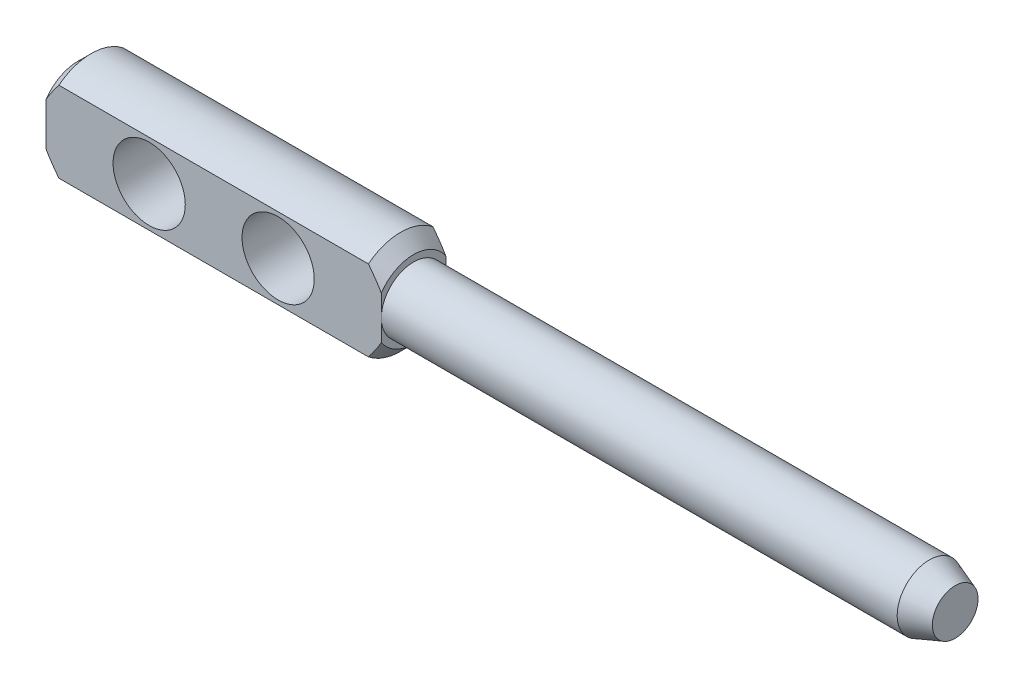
ISO-10303-21;
HEADER;
FILE_DESCRIPTION(('STEP AP214'),'2;1');
FILE_NAME('part.step','',(''),(''),'','','');
FILE_SCHEMA(('AUTOMOTIVE_DESIGN { 1 0 10303 214 1 1 1 1 }'));
ENDSEC;
DATA;
#1=APPLICATION_CONTEXT('core data for automotive mechanical design processes');
#2=APPLICATION_PROTOCOL_DEFINITION('international standard','automotive_design',2000,#1);
#3=PRODUCT_CONTEXT('',#1,'mechanical');
#4=PRODUCT('Part','Part','',(#3));
#5=PRODUCT_RELATED_PRODUCT_CATEGORY('part','',(#4));
#6=PRODUCT_DEFINITION_FORMATION('','',#4);
#7=PRODUCT_DEFINITION_CONTEXT('part definition',#1,'design');
#8=PRODUCT_DEFINITION('design','',#6,#7);
#9=PRODUCT_DEFINITION_SHAPE('','',#8);
#10=(LENGTH_UNIT() NAMED_UNIT(*) SI_UNIT(.MILLI.,.METRE.));
#11=(NAMED_UNIT(*) PLANE_ANGLE_UNIT() SI_UNIT($,.RADIAN.));
#12=(NAMED_UNIT(*) SI_UNIT($,.STERADIAN.) SOLID_ANGLE_UNIT());
#13=UNCERTAINTY_MEASURE_WITH_UNIT(LENGTH_MEASURE(1.E-05),#10,'distance_accuracy_value','');
#14=(GEOMETRIC_REPRESENTATION_CONTEXT(3) GLOBAL_UNCERTAINTY_ASSIGNED_CONTEXT((#13)) GLOBAL_UNIT_ASSIGNED_CONTEXT((#10,
#11,#12)) REPRESENTATION_CONTEXT('',''));
#15=CARTESIAN_POINT('',(0.,0.,0.));
#16=DIRECTION('',(0.,0.,1.));
#17=DIRECTION('',(1.,0.,0.));
#18=AXIS2_PLACEMENT_3D('',#15,#16,#17);
#19=CARTESIAN_POINT('',(0.,0.,0.));
#20=DIRECTION('',(1.,0.,0.));
#21=DIRECTION('',(0.,0.,-1.));
#22=AXIS2_PLACEMENT_3D('',#19,#20,#21);
#23=PLANE('',#22);
#24=DIRECTION('',(0.,1.,0.));
#25=VECTOR('',#24,1.);
#26=CARTESIAN_POINT('',(0.,-2.,1.25));
#27=LINE('',#26,#25);
#28=CARTESIAN_POINT('',(0.,-0.82915619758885,1.25));
#29=VERTEX_POINT('',#28);
#30=CARTESIAN_POINT('',(0.,0.82915619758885,1.25));
#31=VERTEX_POINT('',#30);
#32=EDGE_CURVE('E115',#29,#31,#27,.T.);
#33=ORIENTED_EDGE('',*,*,#32,.T.);
#34=CARTESIAN_POINT('',(0.,0.,0.));
#35=DIRECTION('',(-1.,0.,0.));
#36=DIRECTION('',(0.,0.,1.));
#37=AXIS2_PLACEMENT_3D('',#34,#35,#36);
#38=CIRCLE('',#37,1.5);
#39=CARTESIAN_POINT('',(0.,0.82915619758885,-1.25));
#40=VERTEX_POINT('',#39);
#41=EDGE_CURVE('E12',#31,#40,#38,.T.);
#42=ORIENTED_EDGE('',*,*,#41,.T.);
#43=DIRECTION('',(0.,-1.,0.));
#44=VECTOR('',#43,1.);
#45=CARTESIAN_POINT('',(0.,-2.,-1.25));
#46=LINE('',#45,#44);
#47=CARTESIAN_POINT('',(0.,-0.82915619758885,-1.25));
#48=VERTEX_POINT('',#47);
#49=EDGE_CURVE('E103',#40,#48,#46,.T.);
#50=ORIENTED_EDGE('',*,*,#49,.T.);
#51=EDGE_CURVE('E41',#48,#29,#38,.T.);
#52=ORIENTED_EDGE('',*,*,#51,.T.);
#53=EDGE_LOOP('',(#33,#42,#50,#52));
#54=FACE_BOUND('',#53,.T.);
#55=ADVANCED_FACE('F34',(#54),#23,.F.);
#56=CARTESIAN_POINT('',(0.5,0.,0.));
#57=DIRECTION('',(1.,0.,0.));
#58=DIRECTION('',(0.,0.,-1.));
#59=AXIS2_PLACEMENT_3D('',#56,#57,#58);
#60=CONICAL_SURFACE('',#59,2.,0.785398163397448);
#61=CARTESIAN_POINT('',(2.91887732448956,4.23839318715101,1.25));
#62=CARTESIAN_POINT('',(2.83994802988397,4.15610059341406,1.25));
#63=CARTESIAN_POINT('',(2.76111209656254,4.07371834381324,1.25));
#64=CARTESIAN_POINT('',(2.60366859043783,3.90873465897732,1.25));
#65=CARTESIAN_POINT('',(2.52506101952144,3.82613322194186,1.25));
#66=CARTESIAN_POINT('',(2.28960102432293,3.57789572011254,1.25));
#67=CARTESIAN_POINT('',(2.13315585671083,3.41187280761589,1.25));
#68=CARTESIAN_POINT('',(1.82490719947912,3.08155782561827,1.25));
#69=CARTESIAN_POINT('',(1.67307261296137,2.91729489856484,1.25));
#70=CARTESIAN_POINT('',(1.4472026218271,2.66920473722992,1.25));
#71=CARTESIAN_POINT('',(1.37223089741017,2.58623062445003,1.25));
#72=CARTESIAN_POINT('',(1.22310864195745,2.41954849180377,1.25));
#73=CARTESIAN_POINT('',(1.14895809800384,2.33584048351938,1.25));
#74=CARTESIAN_POINT('',(1.01173848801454,2.17889323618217,1.25));
#75=CARTESIAN_POINT('',(0.948531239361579,2.10577500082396,1.25));
#76=CARTESIAN_POINT('',(0.823192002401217,1.95862442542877,1.25));
#77=CARTESIAN_POINT('',(0.761059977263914,1.8845921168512,1.25));
#78=CARTESIAN_POINT('',(0.637480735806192,1.73440785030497,1.25));
#79=CARTESIAN_POINT('',(0.576051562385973,1.65824099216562,1.25));
#80=CARTESIAN_POINT('',(0.455270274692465,1.5042826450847,1.25));
#81=CARTESIAN_POINT('',(0.395917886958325,1.42649137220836,1.25));
#82=CARTESIAN_POINT('',(0.279214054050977,1.26731557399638,1.25));
#83=CARTESIAN_POINT('',(0.221915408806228,1.18589207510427,1.25));
#84=CARTESIAN_POINT('',(0.111945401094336,1.01969809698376,1.25));
#85=CARTESIAN_POINT('',(0.0592822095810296,0.934922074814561,1.25));
#86=CARTESIAN_POINT('',(-0.0135545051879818,0.805144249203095,1.25));
#87=CARTESIAN_POINT('',(-0.0366497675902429,0.761798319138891,1.25));
#88=CARTESIAN_POINT('',(-0.0804250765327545,0.67390968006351,1.25));
#89=CARTESIAN_POINT('',(-0.101104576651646,0.629366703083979,1.25));
#90=CARTESIAN_POINT('',(-0.158384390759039,0.494031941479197,1.25));
#91=CARTESIAN_POINT('',(-0.190468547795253,0.401126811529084,1.25));
#92=CARTESIAN_POINT('',(-0.223066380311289,0.264050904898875,1.25));
#93=CARTESIAN_POINT('',(-0.231202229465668,0.221669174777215,1.25));
#94=CARTESIAN_POINT('',(-0.243299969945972,0.136296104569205,1.25));
#95=CARTESIAN_POINT('',(-0.247261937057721,0.0933047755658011,1.25));
#96=CARTESIAN_POINT('',(-0.250716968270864,0.00724157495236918,1.25));
#97=CARTESIAN_POINT('',(-0.250220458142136,-0.0358298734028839,1.25));
#98=CARTESIAN_POINT('',(-0.244821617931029,-0.121695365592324,1.25));
#99=CARTESIAN_POINT('',(-0.239918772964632,-0.164489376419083,1.25));
#100=CARTESIAN_POINT('',(-0.226127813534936,-0.248935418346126,1.25));
#101=CARTESIAN_POINT('',(-0.217283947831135,-0.290594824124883,1.25));
#102=CARTESIAN_POINT('',(-0.196139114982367,-0.373016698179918,1.25));
#103=CARTESIAN_POINT('',(-0.183837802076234,-0.413779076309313,1.25));
#104=CARTESIAN_POINT('',(-0.156270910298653,-0.494527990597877,1.25));
#105=CARTESIAN_POINT('',(-0.140989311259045,-0.534508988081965,1.25));
#106=CARTESIAN_POINT('',(-0.108043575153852,-0.613454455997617,1.25));
#107=CARTESIAN_POINT('',(-0.0903799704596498,-0.652419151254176,1.25));
#108=CARTESIAN_POINT('',(-0.0306964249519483,-0.77582569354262,1.25));
#109=CARTESIAN_POINT('',(0.0150191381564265,-0.858474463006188,1.25));
#110=CARTESIAN_POINT('',(0.112257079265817,-1.02031677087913,1.25));
#111=CARTESIAN_POINT('',(0.163787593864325,-1.09950524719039,1.25));
#112=CARTESIAN_POINT('',(0.270827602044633,-1.25561290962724,1.25));
#113=CARTESIAN_POINT('',(0.3263528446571,-1.33252121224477,1.25));
#114=CARTESIAN_POINT('',(0.439924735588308,-1.48436480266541,1.25));
#115=CARTESIAN_POINT('',(0.497969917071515,-1.55930119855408,1.25));
#116=CARTESIAN_POINT('',(0.6165192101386,-1.70857593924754,1.25));
#117=CARTESIAN_POINT('',(0.677043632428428,-1.78289808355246,1.25));
#118=CARTESIAN_POINT('',(0.799436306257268,-1.93043904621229,1.25));
#119=CARTESIAN_POINT('',(0.861304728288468,-2.00365772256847,1.25));
#120=CARTESIAN_POINT('',(1.04808115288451,-2.22168460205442,1.25));
#121=CARTESIAN_POINT('',(1.17445865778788,-2.36523162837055,1.25));
#122=CARTESIAN_POINT('',(1.43527309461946,-2.65662995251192,1.25));
#123=CARTESIAN_POINT('',(1.56981697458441,-2.80438474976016,1.25));
#124=CARTESIAN_POINT('',(1.84064825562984,-3.09850136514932,1.25));
#125=CARTESIAN_POINT('',(1.97693695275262,-3.24486198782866,1.25));
#126=CARTESIAN_POINT('',(2.24715605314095,-3.53286042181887,1.25));
#127=CARTESIAN_POINT('',(2.38105897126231,-3.67452408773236,1.25));
#128=CARTESIAN_POINT('',(2.64951913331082,-3.95700163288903,1.25));
#129=CARTESIAN_POINT('',(2.78407572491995,-4.09781613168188,1.25));
#130=CARTESIAN_POINT('',(2.91887732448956,-4.23839318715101,1.25));
#131=B_SPLINE_CURVE_WITH_KNOTS('',3,(#61,#62,#63,#64,#65,#66,#67,#68,#69,#70,#71,#72,#73,#74,
#75,#76,#77,#78,#79,#80,#81,#82,#83,#84,#85,#86,#87,#88,#89,#90,#91,#92,#93,#94,#95,#96,#97,#98,
#99,#100,#101,#102,#103,#104,#105,#106,#107,#108,#109,#110,#111,#112,#113,#114,#115,#116,#117,
#118,#119,#120,#121,#122,#123,#124,#125,#126,#127,#128,#129,#130),.UNSPECIFIED.,.F.,.F.,(4,2,2,
2,2,2,2,2,2,2,2,2,2,2,2,2,2,2,2,2,2,2,2,2,2,2,2,2,2,2,2,2,2,2,4),(0.,0.342077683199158,
0.684158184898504,1.36851201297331,2.03955509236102,2.37503472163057,2.71050906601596,
3.00045473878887,3.29039046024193,3.58392110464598,3.87741295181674,4.17601256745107,
4.47512840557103,4.6223996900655,4.76970422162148,5.06289781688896,5.19219373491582,
5.32148730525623,5.45047861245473,5.57948499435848,5.70707805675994,5.83468388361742,
5.96299554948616,6.09127858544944,6.37418328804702,6.65748887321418,6.94198005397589,
7.22630779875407,7.51383277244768,7.80139443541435,8.37509716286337,8.97458385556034,
9.57454517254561,10.1593389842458,10.7436361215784),.UNSPECIFIED.);
#132=CARTESIAN_POINT('',(0.5,1.5612494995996,1.25));
#133=VERTEX_POINT('',#132);
#134=EDGE_CURVE('E173',#133,#31,#131,.T.);
#135=ORIENTED_EDGE('',*,*,#134,.F.);
#136=CARTESIAN_POINT('',(0.5,0.,0.));
#137=DIRECTION('',(-1.,0.,0.));
#138=DIRECTION('',(0.,0.,1.));
#139=AXIS2_PLACEMENT_3D('',#136,#137,#138);
#140=CIRCLE('',#139,2.);
#141=CARTESIAN_POINT('',(0.5,1.5612494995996,-1.25));
#142=VERTEX_POINT('',#141);
#143=EDGE_CURVE('E122',#133,#142,#140,.T.);
#144=ORIENTED_EDGE('',*,*,#143,.T.);
#145=CARTESIAN_POINT('',(2.91887732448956,-4.23839318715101,-1.25));
#146=CARTESIAN_POINT('',(2.83994802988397,-4.15610059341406,-1.25));
#147=CARTESIAN_POINT('',(2.76111209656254,-4.07371834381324,-1.25));
#148=CARTESIAN_POINT('',(2.60366859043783,-3.90873465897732,-1.25));
#149=CARTESIAN_POINT('',(2.52506101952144,-3.82613322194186,-1.25));
#150=CARTESIAN_POINT('',(2.28960102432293,-3.57789572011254,-1.25));
#151=CARTESIAN_POINT('',(2.13315585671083,-3.41187280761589,-1.25));
#152=CARTESIAN_POINT('',(1.82490719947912,-3.08155782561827,-1.25));
#153=CARTESIAN_POINT('',(1.67307261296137,-2.91729489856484,-1.25));
#154=CARTESIAN_POINT('',(1.4472026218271,-2.66920473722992,-1.25));
#155=CARTESIAN_POINT('',(1.37223089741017,-2.58623062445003,-1.25));
#156=CARTESIAN_POINT('',(1.22310864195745,-2.41954849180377,-1.25));
#157=CARTESIAN_POINT('',(1.14895809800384,-2.33584048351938,-1.25));
#158=CARTESIAN_POINT('',(1.01173848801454,-2.17889323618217,-1.25));
#159=CARTESIAN_POINT('',(0.948531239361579,-2.10577500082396,-1.25));
#160=CARTESIAN_POINT('',(0.823192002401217,-1.95862442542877,-1.25));
#161=CARTESIAN_POINT('',(0.761059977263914,-1.8845921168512,-1.25));
#162=CARTESIAN_POINT('',(0.637480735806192,-1.73440785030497,-1.25));
#163=CARTESIAN_POINT('',(0.576051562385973,-1.65824099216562,-1.25));
#164=CARTESIAN_POINT('',(0.455270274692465,-1.5042826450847,-1.25));
#165=CARTESIAN_POINT('',(0.395917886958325,-1.42649137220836,-1.25));
#166=CARTESIAN_POINT('',(0.279214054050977,-1.26731557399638,-1.25));
#167=CARTESIAN_POINT('',(0.221915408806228,-1.18589207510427,-1.25));
#168=CARTESIAN_POINT('',(0.111945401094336,-1.01969809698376,-1.25));
#169=CARTESIAN_POINT('',(0.0592822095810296,-0.934922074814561,-1.25));
#170=CARTESIAN_POINT('',(-0.0135545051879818,-0.805144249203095,-1.25));
#171=CARTESIAN_POINT('',(-0.0366497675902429,-0.761798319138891,-1.25));
#172=CARTESIAN_POINT('',(-0.0804250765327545,-0.67390968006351,-1.25));
#173=CARTESIAN_POINT('',(-0.101104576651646,-0.629366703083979,-1.25));
#174=CARTESIAN_POINT('',(-0.158384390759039,-0.494031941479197,-1.25));
#175=CARTESIAN_POINT('',(-0.190468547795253,-0.401126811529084,-1.25));
#176=CARTESIAN_POINT('',(-0.223066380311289,-0.264050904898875,-1.25));
#177=CARTESIAN_POINT('',(-0.231202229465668,-0.221669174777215,-1.25));
#178=CARTESIAN_POINT('',(-0.243299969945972,-0.136296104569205,-1.25));
#179=CARTESIAN_POINT('',(-0.247261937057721,-0.0933047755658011,-1.25));
#180=CARTESIAN_POINT('',(-0.250716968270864,-0.00724157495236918,-1.25));
#181=CARTESIAN_POINT('',(-0.250220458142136,0.0358298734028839,-1.25));
#182=CARTESIAN_POINT('',(-0.244821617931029,0.121695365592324,-1.25));
#183=CARTESIAN_POINT('',(-0.239918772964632,0.164489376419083,-1.25));
#184=CARTESIAN_POINT('',(-0.226127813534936,0.248935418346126,-1.25));
#185=CARTESIAN_POINT('',(-0.217283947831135,0.290594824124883,-1.25));
#186=CARTESIAN_POINT('',(-0.196139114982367,0.373016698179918,-1.25));
#187=CARTESIAN_POINT('',(-0.183837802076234,0.413779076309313,-1.25));
#188=CARTESIAN_POINT('',(-0.156270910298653,0.494527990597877,-1.25));
#189=CARTESIAN_POINT('',(-0.140989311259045,0.534508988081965,-1.25));
#190=CARTESIAN_POINT('',(-0.108043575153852,0.613454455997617,-1.25));
#191=CARTESIAN_POINT('',(-0.0903799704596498,0.652419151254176,-1.25));
#192=CARTESIAN_POINT('',(-0.0306964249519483,0.77582569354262,-1.25));
#193=CARTESIAN_POINT('',(0.0150191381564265,0.858474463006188,-1.25));
#194=CARTESIAN_POINT('',(0.112257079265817,1.02031677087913,-1.25));
#195=CARTESIAN_POINT('',(0.163787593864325,1.09950524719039,-1.25));
#196=CARTESIAN_POINT('',(0.270827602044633,1.25561290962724,-1.25));
#197=CARTESIAN_POINT('',(0.3263528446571,1.33252121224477,-1.25));
#198=CARTESIAN_POINT('',(0.439924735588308,1.48436480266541,-1.25));
#199=CARTESIAN_POINT('',(0.497969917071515,1.55930119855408,-1.25));
#200=CARTESIAN_POINT('',(0.6165192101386,1.70857593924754,-1.25));
#201=CARTESIAN_POINT('',(0.677043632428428,1.78289808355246,-1.25));
#202=CARTESIAN_POINT('',(0.799436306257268,1.93043904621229,-1.25));
#203=CARTESIAN_POINT('',(0.861304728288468,2.00365772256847,-1.25));
#204=CARTESIAN_POINT('',(1.04808115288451,2.22168460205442,-1.25));
#205=CARTESIAN_POINT('',(1.17445865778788,2.36523162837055,-1.25));
#206=CARTESIAN_POINT('',(1.43527309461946,2.65662995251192,-1.25));
#207=CARTESIAN_POINT('',(1.56981697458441,2.80438474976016,-1.25));
#208=CARTESIAN_POINT('',(1.84064825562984,3.09850136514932,-1.25));
#209=CARTESIAN_POINT('',(1.97693695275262,3.24486198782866,-1.25));
#210=CARTESIAN_POINT('',(2.24715605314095,3.53286042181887,-1.25));
#211=CARTESIAN_POINT('',(2.38105897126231,3.67452408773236,-1.25));
#212=CARTESIAN_POINT('',(2.64951913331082,3.95700163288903,-1.25));
#213=CARTESIAN_POINT('',(2.78407572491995,4.09781613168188,-1.25));
#214=CARTESIAN_POINT('',(2.91887732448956,4.23839318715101,-1.25));
#215=B_SPLINE_CURVE_WITH_KNOTS('',3,(#145,#146,#147,#148,#149,#150,#151,#152,#153,#154,#155,
#156,#157,#158,#159,#160,#161,#162,#163,#164,#165,#166,#167,#168,#169,#170,#171,#172,#173,#174,
#175,#176,#177,#178,#179,#180,#181,#182,#183,#184,#185,#186,#187,#188,#189,#190,#191,#192,#193,
#194,#195,#196,#197,#198,#199,#200,#201,#202,#203,#204,#205,#206,#207,#208,#209,#210,#211,#212,
#213,#214),.UNSPECIFIED.,.F.,.F.,(4,2,2,2,2,2,2,2,2,2,2,2,2,2,2,2,2,2,2,2,2,2,2,2,2,2,2,2,2,2,2,
2,2,2,4),(0.,0.342077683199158,0.684158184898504,1.36851201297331,2.03955509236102,
2.37503472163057,2.71050906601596,3.00045473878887,3.29039046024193,3.58392110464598,
3.87741295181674,4.17601256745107,4.47512840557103,4.6223996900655,4.76970422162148,
5.06289781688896,5.19219373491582,5.32148730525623,5.45047861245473,5.57948499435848,
5.70707805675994,5.83468388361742,5.96299554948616,6.09127858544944,6.37418328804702,
6.65748887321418,6.94198005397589,7.22630779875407,7.51383277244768,7.80139443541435,
8.37509716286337,8.97458385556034,9.57454517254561,10.1593389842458,10.7436361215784),.UNSPECIFIED.);
#216=EDGE_CURVE('E107',#40,#142,#215,.T.);
#217=ORIENTED_EDGE('',*,*,#216,.F.);
#218=ORIENTED_EDGE('',*,*,#41,.F.);
#219=EDGE_LOOP('',(#135,#144,#217,#218));
#220=FACE_BOUND('',#219,.T.);
#221=ADVANCED_FACE('F120',(#220),#60,.T.);
#222=CARTESIAN_POINT('',(0.5,-1.5612494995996,1.25));
#223=VERTEX_POINT('',#222);
#224=EDGE_CURVE('E180',#29,#223,#131,.T.);
#225=ORIENTED_EDGE('',*,*,#224,.F.);
#226=ORIENTED_EDGE('',*,*,#51,.F.);
#227=CARTESIAN_POINT('',(0.5,-1.5612494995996,-1.25));
#228=VERTEX_POINT('',#227);
#229=EDGE_CURVE('E110',#228,#48,#215,.T.);
#230=ORIENTED_EDGE('',*,*,#229,.F.);
#231=EDGE_CURVE('E202',#228,#223,#140,.T.);
#232=ORIENTED_EDGE('',*,*,#231,.T.);
#233=EDGE_LOOP('',(#225,#226,#230,#232));
#234=FACE_BOUND('',#233,.T.);
#235=ADVANCED_FACE('F169',(#234),#60,.T.);
#236=CARTESIAN_POINT('',(0.,0.,0.));
#237=DIRECTION('',(-1.,0.,0.));
#238=DIRECTION('',(0.,0.,1.));
#239=AXIS2_PLACEMENT_3D('',#236,#237,#238);
#240=CYLINDRICAL_SURFACE('',#239,2.);
#241=CARTESIAN_POINT('',(12.5,0.,0.));
#242=DIRECTION('',(-1.,0.,0.));
#243=DIRECTION('',(0.,0.,1.));
#244=AXIS2_PLACEMENT_3D('',#241,#242,#243);
#245=CIRCLE('',#244,2.);
#246=CARTESIAN_POINT('',(12.5,-1.5612494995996,-1.25));
#247=VERTEX_POINT('',#246);
#248=CARTESIAN_POINT('',(12.4999999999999,-1.56124949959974,1.25));
#249=VERTEX_POINT('',#248);
#250=EDGE_CURVE('E200',#247,#249,#245,.T.);
#251=ORIENTED_EDGE('',*,*,#250,.T.);
#252=DIRECTION('',(-1.,0.,0.));
#253=VECTOR('',#252,1.);
#254=CARTESIAN_POINT('',(0.,-1.5612494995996,1.25));
#255=LINE('',#254,#253);
#256=EDGE_CURVE('E182',#223,#249,#255,.F.);
#257=ORIENTED_EDGE('',*,*,#256,.F.);
#258=ORIENTED_EDGE('',*,*,#231,.F.);
#259=DIRECTION('',(-1.,0.,0.));
#260=VECTOR('',#259,1.);
#261=CARTESIAN_POINT('',(0.,-1.5612494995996,-1.25));
#262=LINE('',#261,#260);
#263=EDGE_CURVE('E144',#247,#228,#262,.T.);
#264=ORIENTED_EDGE('',*,*,#263,.F.);
#265=EDGE_LOOP('',(#251,#257,#258,#264));
#266=FACE_BOUND('',#265,.T.);
#267=ADVANCED_FACE('F170',(#266),#240,.T.);
#268=DIRECTION('',(-1.,0.,0.));
#269=VECTOR('',#268,1.);
#270=CARTESIAN_POINT('',(0.,1.5612494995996,-1.25));
#271=LINE('',#270,#269);
#272=CARTESIAN_POINT('',(12.4999999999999,1.56124949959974,-1.25));
#273=VERTEX_POINT('',#272);
#274=EDGE_CURVE('E124',#142,#273,#271,.F.);
#275=ORIENTED_EDGE('',*,*,#274,.F.);
#276=ORIENTED_EDGE('',*,*,#143,.F.);
#277=DIRECTION('',(-1.,0.,0.));
#278=VECTOR('',#277,1.);
#279=CARTESIAN_POINT('',(0.,1.5612494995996,1.25));
#280=LINE('',#279,#278);
#281=CARTESIAN_POINT('',(12.5,1.5612494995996,1.25));
#282=VERTEX_POINT('',#281);
#283=EDGE_CURVE('E179',#282,#133,#280,.T.);
#284=ORIENTED_EDGE('',*,*,#283,.F.);
#285=EDGE_CURVE('E201',#282,#273,#245,.T.);
#286=ORIENTED_EDGE('',*,*,#285,.T.);
#287=EDGE_LOOP('',(#275,#276,#284,#286));
#288=FACE_BOUND('',#287,.T.);
#289=ADVANCED_FACE('F230',(#288),#240,.T.);
#290=CARTESIAN_POINT('',(13.,0.,0.));
#291=DIRECTION('',(-1.,0.,0.));
#292=DIRECTION('',(0.,0.,1.));
#293=AXIS2_PLACEMENT_3D('',#290,#291,#292);
#294=CONICAL_SURFACE('',#293,1.5,0.78539816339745);
#295=CARTESIAN_POINT('',(10.0811226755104,-4.23839318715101,1.25));
#296=CARTESIAN_POINT('',(10.160051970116,-4.15610059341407,1.25));
#297=CARTESIAN_POINT('',(10.2388879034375,-4.07371834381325,1.25));
#298=CARTESIAN_POINT('',(10.3963314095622,-3.90873465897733,1.25));
#299=CARTESIAN_POINT('',(10.4749389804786,-3.82613322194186,1.25));
#300=CARTESIAN_POINT('',(10.7103989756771,-3.57789572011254,1.25));
#301=CARTESIAN_POINT('',(10.8668441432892,-3.4118728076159,1.25));
#302=CARTESIAN_POINT('',(11.1750928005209,-3.08155782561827,1.25));
#303=CARTESIAN_POINT('',(11.3269273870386,-2.91729489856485,1.25));
#304=CARTESIAN_POINT('',(11.5527973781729,-2.66920473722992,1.25));
#305=CARTESIAN_POINT('',(11.6277691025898,-2.58623062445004,1.25));
#306=CARTESIAN_POINT('',(11.7768913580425,-2.41954849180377,1.25));
#307=CARTESIAN_POINT('',(11.8510419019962,-2.33584048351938,1.25));
#308=CARTESIAN_POINT('',(11.9882615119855,-2.17889323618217,1.25));
#309=CARTESIAN_POINT('',(12.0514687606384,-2.10577500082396,1.25));
#310=CARTESIAN_POINT('',(12.1768079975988,-1.95862442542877,1.25));
#311=CARTESIAN_POINT('',(12.2389400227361,-1.8845921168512,1.25));
#312=CARTESIAN_POINT('',(12.3625192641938,-1.73440785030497,1.25));
#313=CARTESIAN_POINT('',(12.423948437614,-1.65824099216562,1.25));
#314=CARTESIAN_POINT('',(12.5447297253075,-1.5042826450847,1.25));
#315=CARTESIAN_POINT('',(12.6040821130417,-1.42649137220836,1.25));
#316=CARTESIAN_POINT('',(12.720785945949,-1.26731557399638,1.25));
#317=CARTESIAN_POINT('',(12.7780845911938,-1.18589207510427,1.25));
#318=CARTESIAN_POINT('',(12.8880545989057,-1.01969809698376,1.25));
#319=CARTESIAN_POINT('',(12.940717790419,-0.934922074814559,1.25));
#320=CARTESIAN_POINT('',(13.013554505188,-0.805144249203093,1.25));
#321=CARTESIAN_POINT('',(13.0366497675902,-0.761798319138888,1.25));
#322=CARTESIAN_POINT('',(13.0804250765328,-0.673909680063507,1.25));
#323=CARTESIAN_POINT('',(13.1011045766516,-0.629366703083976,1.25));
#324=CARTESIAN_POINT('',(13.158384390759,-0.494031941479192,1.25));
#325=CARTESIAN_POINT('',(13.1904685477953,-0.401126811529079,1.25));
#326=CARTESIAN_POINT('',(13.2230663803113,-0.26405090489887,1.25));
#327=CARTESIAN_POINT('',(13.2312022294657,-0.22166917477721,1.25));
#328=CARTESIAN_POINT('',(13.243299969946,-0.1362961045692,1.25));
#329=CARTESIAN_POINT('',(13.2472619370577,-0.0933047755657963,1.25));
#330=CARTESIAN_POINT('',(13.2507169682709,-0.00724157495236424,1.25));
#331=CARTESIAN_POINT('',(13.2502204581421,0.0358298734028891,1.25));
#332=CARTESIAN_POINT('',(13.244821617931,0.12169536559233,1.25));
#333=CARTESIAN_POINT('',(13.2399187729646,0.164489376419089,1.25));
#334=CARTESIAN_POINT('',(13.2261278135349,0.248935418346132,1.25));
#335=CARTESIAN_POINT('',(13.2172839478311,0.29059482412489,1.25));
#336=CARTESIAN_POINT('',(13.1961391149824,0.373016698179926,1.25));
#337=CARTESIAN_POINT('',(13.1838378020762,0.413779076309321,1.25));
#338=CARTESIAN_POINT('',(13.1562709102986,0.494527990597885,1.25));
#339=CARTESIAN_POINT('',(13.140989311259,0.534508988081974,1.25));
#340=CARTESIAN_POINT('',(13.1080435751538,0.613454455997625,1.25));
#341=CARTESIAN_POINT('',(13.0903799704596,0.652419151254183,1.25));
#342=CARTESIAN_POINT('',(13.0306964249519,0.775825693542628,1.25));
#343=CARTESIAN_POINT('',(12.9849808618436,0.858474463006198,1.25));
#344=CARTESIAN_POINT('',(12.8877429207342,1.02031677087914,1.25));
#345=CARTESIAN_POINT('',(12.8362124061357,1.09950524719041,1.25));
#346=CARTESIAN_POINT('',(12.7291723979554,1.25561290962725,1.25));
#347=CARTESIAN_POINT('',(12.6736471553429,1.33252121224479,1.25));
#348=CARTESIAN_POINT('',(12.5600752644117,1.48436480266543,1.25));
#349=CARTESIAN_POINT('',(12.5020300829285,1.55930119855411,1.25));
#350=CARTESIAN_POINT('',(12.3834807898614,1.70857593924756,1.25));
#351=CARTESIAN_POINT('',(12.3229563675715,1.78289808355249,1.25));
#352=CARTESIAN_POINT('',(12.2005636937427,1.93043904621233,1.25));
#353=CARTESIAN_POINT('',(12.1386952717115,2.00365772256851,1.25));
#354=CARTESIAN_POINT('',(11.9519188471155,2.22168460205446,1.25));
#355=CARTESIAN_POINT('',(11.8255413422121,2.36523162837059,1.25));
#356=CARTESIAN_POINT('',(11.5647269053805,2.65662995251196,1.25));
#357=CARTESIAN_POINT('',(11.4301830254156,2.8043847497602,1.25));
#358=CARTESIAN_POINT('',(11.1593517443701,3.09850136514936,1.25));
#359=CARTESIAN_POINT('',(11.0230630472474,3.24486198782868,1.25));
#360=CARTESIAN_POINT('',(10.752843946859,3.53286042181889,1.25));
#361=CARTESIAN_POINT('',(10.6189410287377,3.67452408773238,1.25));
#362=CARTESIAN_POINT('',(10.3504808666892,3.95700163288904,1.25));
#363=CARTESIAN_POINT('',(10.2159242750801,4.09781613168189,1.25));
#364=CARTESIAN_POINT('',(10.0811226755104,4.23839318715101,1.25));
#365=B_SPLINE_CURVE_WITH_KNOTS('',3,(#295,#296,#297,#298,#299,#300,#301,#302,#303,#304,#305,
#306,#307,#308,#309,#310,#311,#312,#313,#314,#315,#316,#317,#318,#319,#320,#321,#322,#323,#324,
#325,#326,#327,#328,#329,#330,#331,#332,#333,#334,#335,#336,#337,#338,#339,#340,#341,#342,#343,
#344,#345,#346,#347,#348,#349,#350,#351,#352,#353,#354,#355,#356,#357,#358,#359,#360,#361,#362,
#363,#364),.UNSPECIFIED.,.F.,.F.,(4,2,2,2,2,2,2,2,2,2,2,2,2,2,2,2,2,2,2,2,2,2,2,2,2,2,2,2,2,2,2,
2,2,2,4),(0.,0.342077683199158,0.684158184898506,1.36851201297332,2.03955509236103,
2.37503472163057,2.71050906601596,3.00045473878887,3.29039046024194,3.58392110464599,
3.87741295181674,4.17601256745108,4.47512840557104,4.6223996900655,4.76970422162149,
5.06289781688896,5.19219373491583,5.32148730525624,5.45047861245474,5.57948499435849,
5.70707805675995,5.83468388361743,5.96299554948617,6.09127858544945,6.37418328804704,
6.6574888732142,6.94198005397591,7.22630779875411,7.51383277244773,7.80139443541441,
8.37509716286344,8.9745838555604,9.57454517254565,10.1593389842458,10.7436361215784),.UNSPECIFIED.);
#366=CARTESIAN_POINT('',(13.,-0.82915619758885,1.25));
#367=VERTEX_POINT('',#366);
#368=EDGE_CURVE('E185',#249,#367,#365,.T.);
#369=ORIENTED_EDGE('',*,*,#368,.F.);
#370=ORIENTED_EDGE('',*,*,#250,.F.);
#371=CARTESIAN_POINT('',(10.0811226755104,4.23839318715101,-1.25));
#372=CARTESIAN_POINT('',(10.160051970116,4.15610059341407,-1.25));
#373=CARTESIAN_POINT('',(10.2388879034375,4.07371834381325,-1.25));
#374=CARTESIAN_POINT('',(10.3963314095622,3.90873465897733,-1.25));
#375=CARTESIAN_POINT('',(10.4749389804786,3.82613322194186,-1.25));
#376=CARTESIAN_POINT('',(10.7103989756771,3.57789572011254,-1.25));
#377=CARTESIAN_POINT('',(10.8668441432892,3.4118728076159,-1.25));
#378=CARTESIAN_POINT('',(11.1750928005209,3.08155782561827,-1.25));
#379=CARTESIAN_POINT('',(11.3269273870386,2.91729489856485,-1.25));
#380=CARTESIAN_POINT('',(11.5527973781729,2.66920473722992,-1.25));
#381=CARTESIAN_POINT('',(11.6277691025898,2.58623062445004,-1.25));
#382=CARTESIAN_POINT('',(11.7768913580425,2.41954849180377,-1.25));
#383=CARTESIAN_POINT('',(11.8510419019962,2.33584048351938,-1.25));
#384=CARTESIAN_POINT('',(11.9882615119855,2.17889323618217,-1.25));
#385=CARTESIAN_POINT('',(12.0514687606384,2.10577500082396,-1.25));
#386=CARTESIAN_POINT('',(12.1768079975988,1.95862442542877,-1.25));
#387=CARTESIAN_POINT('',(12.2389400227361,1.8845921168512,-1.25));
#388=CARTESIAN_POINT('',(12.3625192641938,1.73440785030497,-1.25));
#389=CARTESIAN_POINT('',(12.423948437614,1.65824099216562,-1.25));
#390=CARTESIAN_POINT('',(12.5447297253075,1.5042826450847,-1.25));
#391=CARTESIAN_POINT('',(12.6040821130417,1.42649137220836,-1.25));
#392=CARTESIAN_POINT('',(12.720785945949,1.26731557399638,-1.25));
#393=CARTESIAN_POINT('',(12.7780845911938,1.18589207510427,-1.25));
#394=CARTESIAN_POINT('',(12.8880545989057,1.01969809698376,-1.25));
#395=CARTESIAN_POINT('',(12.940717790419,0.934922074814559,-1.25));
#396=CARTESIAN_POINT('',(13.013554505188,0.805144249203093,-1.25));
#397=CARTESIAN_POINT('',(13.0366497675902,0.761798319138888,-1.25));
#398=CARTESIAN_POINT('',(13.0804250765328,0.673909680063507,-1.25));
#399=CARTESIAN_POINT('',(13.1011045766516,0.629366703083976,-1.25));
#400=CARTESIAN_POINT('',(13.158384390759,0.494031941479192,-1.25));
#401=CARTESIAN_POINT('',(13.1904685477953,0.401126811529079,-1.25));
#402=CARTESIAN_POINT('',(13.2230663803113,0.26405090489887,-1.25));
#403=CARTESIAN_POINT('',(13.2312022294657,0.22166917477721,-1.25));
#404=CARTESIAN_POINT('',(13.243299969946,0.1362961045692,-1.25));
#405=CARTESIAN_POINT('',(13.2472619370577,0.0933047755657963,-1.25));
#406=CARTESIAN_POINT('',(13.2507169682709,0.00724157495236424,-1.25));
#407=CARTESIAN_POINT('',(13.2502204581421,-0.0358298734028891,-1.25));
#408=CARTESIAN_POINT('',(13.244821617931,-0.12169536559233,-1.25));
#409=CARTESIAN_POINT('',(13.2399187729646,-0.164489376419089,-1.25));
#410=CARTESIAN_POINT('',(13.2261278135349,-0.248935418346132,-1.25));
#411=CARTESIAN_POINT('',(13.2172839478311,-0.29059482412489,-1.25));
#412=CARTESIAN_POINT('',(13.1961391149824,-0.373016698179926,-1.25));
#413=CARTESIAN_POINT('',(13.1838378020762,-0.413779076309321,-1.25));
#414=CARTESIAN_POINT('',(13.1562709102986,-0.494527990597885,-1.25));
#415=CARTESIAN_POINT('',(13.140989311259,-0.534508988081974,-1.25));
#416=CARTESIAN_POINT('',(13.1080435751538,-0.613454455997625,-1.25));
#417=CARTESIAN_POINT('',(13.0903799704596,-0.652419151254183,-1.25));
#418=CARTESIAN_POINT('',(13.0306964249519,-0.775825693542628,-1.25));
#419=CARTESIAN_POINT('',(12.9849808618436,-0.858474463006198,-1.25));
#420=CARTESIAN_POINT('',(12.8877429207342,-1.02031677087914,-1.25));
#421=CARTESIAN_POINT('',(12.8362124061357,-1.09950524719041,-1.25));
#422=CARTESIAN_POINT('',(12.7291723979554,-1.25561290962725,-1.25));
#423=CARTESIAN_POINT('',(12.6736471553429,-1.33252121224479,-1.25));
#424=CARTESIAN_POINT('',(12.5600752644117,-1.48436480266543,-1.25));
#425=CARTESIAN_POINT('',(12.5020300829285,-1.55930119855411,-1.25));
#426=CARTESIAN_POINT('',(12.3834807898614,-1.70857593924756,-1.25));
#427=CARTESIAN_POINT('',(12.3229563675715,-1.78289808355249,-1.25));
#428=CARTESIAN_POINT('',(12.2005636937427,-1.93043904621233,-1.25));
#429=CARTESIAN_POINT('',(12.1386952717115,-2.00365772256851,-1.25));
#430=CARTESIAN_POINT('',(11.9519188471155,-2.22168460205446,-1.25));
#431=CARTESIAN_POINT('',(11.8255413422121,-2.36523162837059,-1.25));
#432=CARTESIAN_POINT('',(11.5647269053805,-2.65662995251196,-1.25));
#433=CARTESIAN_POINT('',(11.4301830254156,-2.8043847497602,-1.25));
#434=CARTESIAN_POINT('',(11.1593517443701,-3.09850136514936,-1.25));
#435=CARTESIAN_POINT('',(11.0230630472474,-3.24486198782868,-1.25));
#436=CARTESIAN_POINT('',(10.752843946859,-3.53286042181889,-1.25));
#437=CARTESIAN_POINT('',(10.6189410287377,-3.67452408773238,-1.25));
#438=CARTESIAN_POINT('',(10.3504808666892,-3.95700163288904,-1.25));
#439=CARTESIAN_POINT('',(10.2159242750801,-4.09781613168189,-1.25));
#440=CARTESIAN_POINT('',(10.0811226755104,-4.23839318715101,-1.25));
#441=B_SPLINE_CURVE_WITH_KNOTS('',3,(#371,#372,#373,#374,#375,#376,#377,#378,#379,#380,#381,
#382,#383,#384,#385,#386,#387,#388,#389,#390,#391,#392,#393,#394,#395,#396,#397,#398,#399,#400,
#401,#402,#403,#404,#405,#406,#407,#408,#409,#410,#411,#412,#413,#414,#415,#416,#417,#418,#419,
#420,#421,#422,#423,#424,#425,#426,#427,#428,#429,#430,#431,#432,#433,#434,#435,#436,#437,#438,
#439,#440),.UNSPECIFIED.,.F.,.F.,(4,2,2,2,2,2,2,2,2,2,2,2,2,2,2,2,2,2,2,2,2,2,2,2,2,2,2,2,2,2,2,
2,2,2,4),(0.,0.342077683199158,0.684158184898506,1.36851201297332,2.03955509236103,
2.37503472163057,2.71050906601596,3.00045473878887,3.29039046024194,3.58392110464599,
3.87741295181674,4.17601256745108,4.47512840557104,4.6223996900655,4.76970422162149,
5.06289781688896,5.19219373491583,5.32148730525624,5.45047861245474,5.57948499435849,
5.70707805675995,5.83468388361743,5.96299554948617,6.09127858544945,6.37418328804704,
6.6574888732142,6.94198005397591,7.22630779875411,7.51383277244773,7.80139443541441,
8.37509716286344,8.9745838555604,9.57454517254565,10.1593389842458,10.7436361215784),.UNSPECIFIED.);
#442=CARTESIAN_POINT('',(13.,-0.82915619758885,-1.25));
#443=VERTEX_POINT('',#442);
#444=EDGE_CURVE('E137',#443,#247,#441,.T.);
#445=ORIENTED_EDGE('',*,*,#444,.F.);
#446=CARTESIAN_POINT('',(13.,0.,0.));
#447=DIRECTION('',(-1.,0.,0.));
#448=DIRECTION('',(0.,0.,1.));
#449=AXIS2_PLACEMENT_3D('',#446,#447,#448);
#450=CIRCLE('',#449,1.5);
#451=EDGE_CURVE('E196',#443,#367,#450,.T.);
#452=ORIENTED_EDGE('',*,*,#451,.T.);
#453=EDGE_LOOP('',(#369,#370,#445,#452));
#454=FACE_BOUND('',#453,.T.);
#455=ADVANCED_FACE('F146',(#454),#294,.T.);
#456=CARTESIAN_POINT('',(13.,0.82915619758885,1.25));
#457=VERTEX_POINT('',#456);
#458=EDGE_CURVE('E214',#457,#282,#365,.T.);
#459=ORIENTED_EDGE('',*,*,#458,.F.);
#460=CARTESIAN_POINT('',(13.,0.82915619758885,-1.25));
#461=VERTEX_POINT('',#460);
#462=EDGE_CURVE('E197',#457,#461,#450,.T.);
#463=ORIENTED_EDGE('',*,*,#462,.T.);
#464=EDGE_CURVE('E145',#273,#461,#441,.T.);
#465=ORIENTED_EDGE('',*,*,#464,.F.);
#466=ORIENTED_EDGE('',*,*,#285,.F.);
#467=EDGE_LOOP('',(#459,#463,#465,#466));
#468=FACE_BOUND('',#467,.T.);
#469=ADVANCED_FACE('F225',(#468),#294,.T.);
#470=CARTESIAN_POINT('',(13.,1.5,0.));
#471=DIRECTION('',(-1.,0.,0.));
#472=DIRECTION('',(0.,0.,1.));
#473=AXIS2_PLACEMENT_3D('',#470,#471,#472);
#474=PLANE('',#473);
#475=DIRECTION('',(0.,1.,0.));
#476=VECTOR('',#475,1.);
#477=CARTESIAN_POINT('',(13.,1.5,1.25));
#478=LINE('',#477,#476);
#479=CARTESIAN_POINT('',(13.,0.,1.25));
#480=VERTEX_POINT('',#479);
#481=EDGE_CURVE('E56',#367,#480,#478,.T.);
#482=ORIENTED_EDGE('',*,*,#481,.F.);
#483=ORIENTED_EDGE('',*,*,#451,.F.);
#484=DIRECTION('',(0.,-1.,0.));
#485=VECTOR('',#484,1.);
#486=CARTESIAN_POINT('',(13.,1.5,-1.25));
#487=LINE('',#486,#485);
#488=CARTESIAN_POINT('',(13.,0.,-1.25));
#489=VERTEX_POINT('',#488);
#490=EDGE_CURVE('E114',#489,#443,#487,.T.);
#491=ORIENTED_EDGE('',*,*,#490,.F.);
#492=CARTESIAN_POINT('',(13.,0.,0.));
#493=DIRECTION('',(-1.,0.,0.));
#494=DIRECTION('',(0.,0.,1.));
#495=AXIS2_PLACEMENT_3D('',#492,#493,#494);
#496=CIRCLE('',#495,1.25);
#497=EDGE_CURVE('E192',#489,#480,#496,.T.);
#498=ORIENTED_EDGE('',*,*,#497,.T.);
#499=EDGE_LOOP('',(#482,#483,#491,#498));
#500=FACE_BOUND('',#499,.T.);
#501=ADVANCED_FACE('F272',(#500),#474,.F.);
#502=EDGE_CURVE('E123',#480,#457,#478,.T.);
#503=ORIENTED_EDGE('',*,*,#502,.F.);
#504=EDGE_CURVE('E193',#480,#489,#496,.T.);
#505=ORIENTED_EDGE('',*,*,#504,.T.);
#506=EDGE_CURVE('E48',#461,#489,#487,.T.);
#507=ORIENTED_EDGE('',*,*,#506,.F.);
#508=ORIENTED_EDGE('',*,*,#462,.F.);
#509=EDGE_LOOP('',(#503,#505,#507,#508));
#510=FACE_BOUND('',#509,.T.);
#511=ADVANCED_FACE('F227',(#510),#474,.F.);
#512=CARTESIAN_POINT('',(0.,0.,0.));
#513=DIRECTION('',(-1.,0.,0.));
#514=DIRECTION('',(0.,0.,1.));
#515=AXIS2_PLACEMENT_3D('',#512,#513,#514);
#516=CYLINDRICAL_SURFACE('',#515,1.25);
#517=ORIENTED_EDGE('',*,*,#504,.F.);
#518=ORIENTED_EDGE('',*,*,#497,.F.);
#519=EDGE_LOOP('',(#517,#518));
#520=FACE_BOUND('',#519,.T.);
#521=CARTESIAN_POINT('',(33.,0.,0.));
#522=DIRECTION('',(-1.,0.,0.));
#523=DIRECTION('',(0.,0.,1.));
#524=AXIS2_PLACEMENT_3D('',#521,#522,#523);
#525=CIRCLE('',#524,1.25);
#526=CARTESIAN_POINT('',(33.,0.,1.25));
#527=VERTEX_POINT('',#526);
#528=EDGE_CURVE('E189',#527,#527,#525,.T.);
#529=ORIENTED_EDGE('',*,*,#528,.T.);
#530=EDGE_LOOP('',(#529));
#531=FACE_BOUND('',#530,.T.);
#532=ADVANCED_FACE('F288',(#520,#531),#516,.T.);
#533=CARTESIAN_POINT('',(34.,0.,0.));
#534=DIRECTION('',(-1.,0.,0.));
#535=DIRECTION('',(0.,0.,1.));
#536=AXIS2_PLACEMENT_3D('',#533,#534,#535);
#537=CONICAL_SURFACE('',#536,0.886029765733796,0.349065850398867);
#538=ORIENTED_EDGE('',*,*,#528,.F.);
#539=EDGE_LOOP('',(#538));
#540=FACE_BOUND('',#539,.T.);
#541=CARTESIAN_POINT('',(34.,0.,0.));
#542=DIRECTION('',(-1.,0.,0.));
#543=DIRECTION('',(0.,0.,1.));
#544=AXIS2_PLACEMENT_3D('',#541,#542,#543);
#545=CIRCLE('',#544,0.886029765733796);
#546=CARTESIAN_POINT('',(34.,0.,0.886029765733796));
#547=VERTEX_POINT('',#546);
#548=EDGE_CURVE('E186',#547,#547,#545,.T.);
#549=ORIENTED_EDGE('',*,*,#548,.T.);
#550=EDGE_LOOP('',(#549));
#551=FACE_BOUND('',#550,.T.);
#552=ADVANCED_FACE('F297',(#540,#551),#537,.T.);
#553=CARTESIAN_POINT('',(34.,0.886029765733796,0.));
#554=DIRECTION('',(-1.,0.,0.));
#555=DIRECTION('',(0.,0.,1.));
#556=AXIS2_PLACEMENT_3D('',#553,#554,#555);
#557=PLANE('',#556);
#558=ORIENTED_EDGE('',*,*,#548,.F.);
#559=EDGE_LOOP('',(#558));
#560=FACE_BOUND('',#559,.T.);
#561=ADVANCED_FACE('F155',(#560),#557,.F.);
#562=CARTESIAN_POINT('',(19.,-2.,-1.25));
#563=DIRECTION('',(0.,0.,-1.));
#564=DIRECTION('',(-1.,0.,0.));
#565=AXIS2_PLACEMENT_3D('',#562,#563,#564);
#566=PLANE('',#565);
#567=CARTESIAN_POINT('',(9.,0.,-1.25));
#568=DIRECTION('',(0.,0.,1.));
#569=DIRECTION('',(1.,0.,0.));
#570=AXIS2_PLACEMENT_3D('',#567,#568,#569);
#571=CIRCLE('',#570,1.4);
#572=CARTESIAN_POINT('',(10.4,0.,-1.25));
#573=VERTEX_POINT('',#572);
#574=EDGE_CURVE('E339',#573,#573,#571,.T.);
#575=ORIENTED_EDGE('',*,*,#574,.T.);
#576=EDGE_LOOP('',(#575));
#577=FACE_BOUND('',#576,.T.);
#578=CARTESIAN_POINT('',(4.,0.,-1.25));
#579=DIRECTION('',(0.,0.,1.));
#580=DIRECTION('',(1.,0.,0.));
#581=AXIS2_PLACEMENT_3D('',#578,#579,#580);
#582=CIRCLE('',#581,1.4);
#583=CARTESIAN_POINT('',(5.4,0.,-1.25));
#584=VERTEX_POINT('',#583);
#585=EDGE_CURVE('E129',#584,#584,#582,.T.);
#586=ORIENTED_EDGE('',*,*,#585,.T.);
#587=EDGE_LOOP('',(#586));
#588=FACE_BOUND('',#587,.T.);
#589=ORIENTED_EDGE('',*,*,#216,.T.);
#590=ORIENTED_EDGE('',*,*,#274,.T.);
#591=ORIENTED_EDGE('',*,*,#464,.T.);
#592=ORIENTED_EDGE('',*,*,#506,.T.);
#593=ORIENTED_EDGE('',*,*,#490,.T.);
#594=ORIENTED_EDGE('',*,*,#444,.T.);
#595=ORIENTED_EDGE('',*,*,#263,.T.);
#596=ORIENTED_EDGE('',*,*,#229,.T.);
#597=ORIENTED_EDGE('',*,*,#49,.F.);
#598=EDGE_LOOP('',(#589,#590,#591,#592,#593,#594,#595,#596,#597));
#599=FACE_BOUND('',#598,.T.);
#600=ADVANCED_FACE('F105',(#577,#588,#599),#566,.T.);
#601=CARTESIAN_POINT('',(19.,-2.,1.25));
#602=DIRECTION('',(0.,0.,1.));
#603=DIRECTION('',(1.,0.,0.));
#604=AXIS2_PLACEMENT_3D('',#601,#602,#603);
#605=PLANE('',#604);
#606=CARTESIAN_POINT('',(9.,0.,1.25));
#607=DIRECTION('',(0.,0.,1.));
#608=DIRECTION('',(1.,0.,0.));
#609=AXIS2_PLACEMENT_3D('',#606,#607,#608);
#610=CIRCLE('',#609,1.4);
#611=CARTESIAN_POINT('',(10.4,0.,1.25));
#612=VERTEX_POINT('',#611);
#613=EDGE_CURVE('E342',#612,#612,#610,.T.);
#614=ORIENTED_EDGE('',*,*,#613,.F.);
#615=EDGE_LOOP('',(#614));
#616=FACE_BOUND('',#615,.T.);
#617=CARTESIAN_POINT('',(4.,0.,1.25));
#618=DIRECTION('',(0.,0.,1.));
#619=DIRECTION('',(1.,0.,0.));
#620=AXIS2_PLACEMENT_3D('',#617,#618,#619);
#621=CIRCLE('',#620,1.4);
#622=CARTESIAN_POINT('',(5.4,0.,1.25));
#623=VERTEX_POINT('',#622);
#624=EDGE_CURVE('E132',#623,#623,#621,.T.);
#625=ORIENTED_EDGE('',*,*,#624,.F.);
#626=EDGE_LOOP('',(#625));
#627=FACE_BOUND('',#626,.T.);
#628=ORIENTED_EDGE('',*,*,#224,.T.);
#629=ORIENTED_EDGE('',*,*,#256,.T.);
#630=ORIENTED_EDGE('',*,*,#368,.T.);
#631=ORIENTED_EDGE('',*,*,#481,.T.);
#632=ORIENTED_EDGE('',*,*,#502,.T.);
#633=ORIENTED_EDGE('',*,*,#458,.T.);
#634=ORIENTED_EDGE('',*,*,#283,.T.);
#635=ORIENTED_EDGE('',*,*,#134,.T.);
#636=ORIENTED_EDGE('',*,*,#32,.F.);
#637=EDGE_LOOP('',(#628,#629,#630,#631,#632,#633,#634,#635,#636));
#638=FACE_BOUND('',#637,.T.);
#639=ADVANCED_FACE('F154',(#616,#627,#638),#605,.T.);
#640=CARTESIAN_POINT('',(4.,0.,-1.25));
#641=DIRECTION('',(0.,0.,1.));
#642=DIRECTION('',(1.,0.,0.));
#643=AXIS2_PLACEMENT_3D('',#640,#641,#642);
#644=CYLINDRICAL_SURFACE('',#643,1.4);
#645=ORIENTED_EDGE('',*,*,#585,.F.);
#646=EDGE_LOOP('',(#645));
#647=FACE_BOUND('',#646,.T.);
#648=ORIENTED_EDGE('',*,*,#624,.T.);
#649=EDGE_LOOP('',(#648));
#650=FACE_BOUND('',#649,.T.);
#651=ADVANCED_FACE('F157',(#647,#650),#644,.F.);
#652=CARTESIAN_POINT('',(9.,0.,-1.25));
#653=DIRECTION('',(0.,0.,1.));
#654=DIRECTION('',(1.,0.,0.));
#655=AXIS2_PLACEMENT_3D('',#652,#653,#654);
#656=CYLINDRICAL_SURFACE('',#655,1.4);
#657=ORIENTED_EDGE('',*,*,#574,.F.);
#658=EDGE_LOOP('',(#657));
#659=FACE_BOUND('',#658,.T.);
#660=ORIENTED_EDGE('',*,*,#613,.T.);
#661=EDGE_LOOP('',(#660));
#662=FACE_BOUND('',#661,.T.);
#663=ADVANCED_FACE('F324',(#659,#662),#656,.F.);
#664=CLOSED_SHELL('',(#55,#221,#235,#267,#289,#455,#469,#501,#511,#532,#552,#561,#600,#639,#651,#663));
#665=MANIFOLD_SOLID_BREP('B2',#664);
#666=ADVANCED_BREP_SHAPE_REPRESENTATION('',(#18,#665),#14);
#667=SHAPE_DEFINITION_REPRESENTATION(#9,#666);
ENDSEC;
END-ISO-10303-21;
